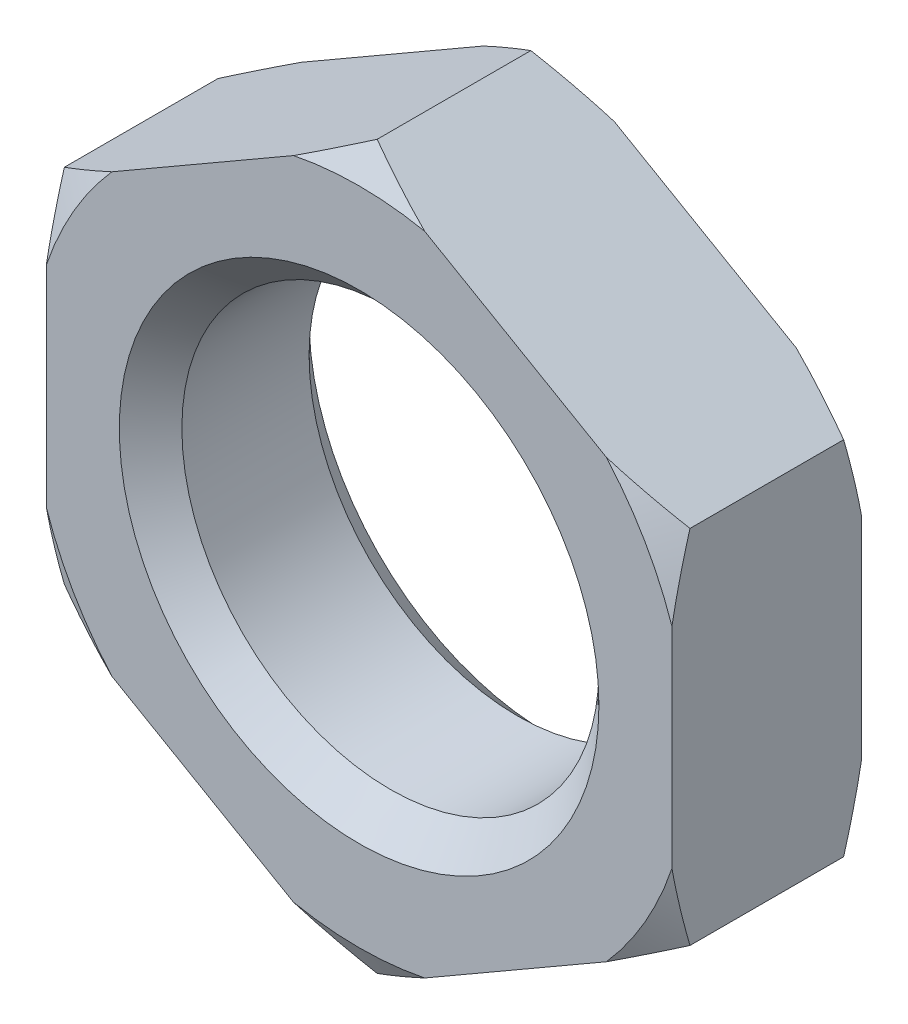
from build123d import *

# Parameters (mm, degrees)
SKETCH1_R           = 10
BOSS_EXTRUDE1_DEPTH = 4.55
CHAMFER1_SIZE       = 1.5


with BuildPart() as part:
    # Sketch1 → Boss-Extrude1 (new, symmetric)
    with BuildSketch(Plane.XY):
        Polygon((0, 17.320508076), (-15, 8.660254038), (-15, -8.660254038), (0, -17.320508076), (15, -8.660254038), (15, 8.660254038), align=None)
        Circle(SKETCH1_R, mode=Mode.SUBTRACT)
    extrude(amount=BOSS_EXTRUDE1_DEPTH, both=True)

    # Sketch3 → Cut-Revolve1 (revolve, cut)
    with BuildSketch(Plane(origin=(0, 0, 0), x_dir=(0, 0, -1), z_dir=(1, 0, 0))):
        Polygon((-4.55, 17.320508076), (-4.55, 15.820508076), (-3.683974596, 17.320508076), align=None)
    cut_revolve1 = revolve(axis=Axis((0, 0, -7.477018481), (0, 0, 1)), mode=Mode.SUBTRACT)

    # Mirror1: Cut-Revolve1 across plane
    add(cut_revolve1.mirror(Plane.XY), mode=Mode.SUBTRACT)

    # Chamfer1
    chamfer1_edges = [part.edges().sort_by_distance(p)[0] for p in [
        (-10, 0, -4.55),
        (-10, 0, 4.55),
    ]]
    chamfer(chamfer1_edges, length=CHAMFER1_SIZE)


solid = part.part
